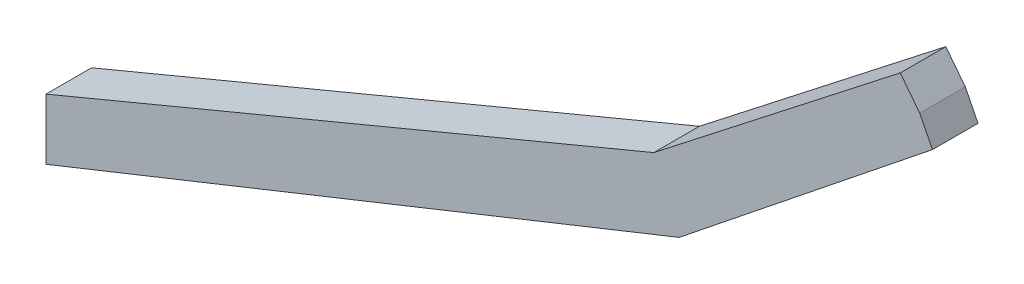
from build123d import *

# Parameters (mm, degrees)
BOSS_EXTRUDE1_DEPTH = 1800
BOSS_EXTRUDE2_DEPTH = 1800


with BuildPart() as part:
    # Sketch1 → Boss-Extrude1 (new body)
    with BuildSketch(Plane.XY):
        Polygon((0, 0), (25000, 10000), (35000, 18000), (34500, 19000), (24500, 11200), (0, 1200), align=None)
    extrude(amount=BOSS_EXTRUDE1_DEPTH)

    # Sketch2 → Boss-Extrude2 (add)
    with BuildSketch(Plane.XY):
        Polygon((0, 1200), (24500, 11200), (34500, 19000), (33728.923153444, 19988.560059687), (24000, 12400), (0, 2400), align=None)
    extrude(amount=BOSS_EXTRUDE2_DEPTH)


solid = part.part
